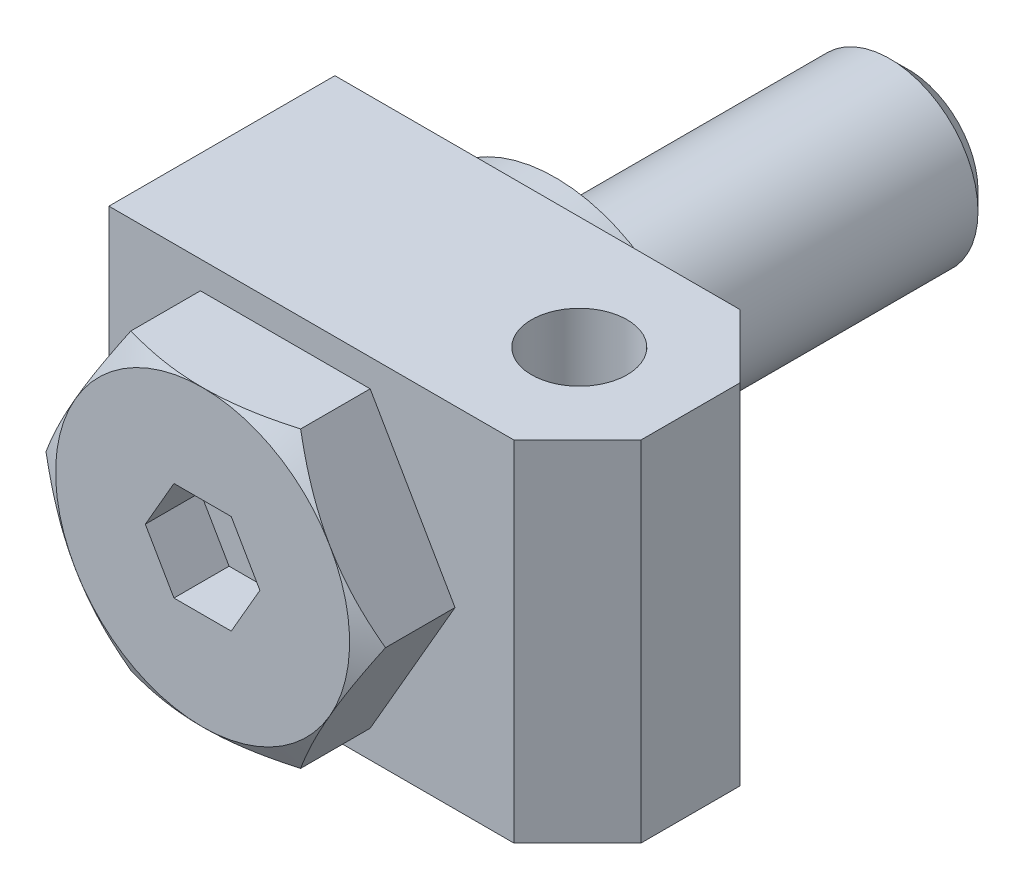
ISO-10303-21;
HEADER;
FILE_DESCRIPTION(('STEP AP214'),'2;1');
FILE_NAME('part.step','',(''),(''),'','','');
FILE_SCHEMA(('AUTOMOTIVE_DESIGN { 1 0 10303 214 1 1 1 1 }'));
ENDSEC;
DATA;
#1=APPLICATION_CONTEXT('core data for automotive mechanical design processes');
#2=APPLICATION_PROTOCOL_DEFINITION('international standard','automotive_design',2000,#1);
#3=PRODUCT_CONTEXT('',#1,'mechanical');
#4=PRODUCT('Part','Part','',(#3));
#5=PRODUCT_RELATED_PRODUCT_CATEGORY('part','',(#4));
#6=PRODUCT_DEFINITION_FORMATION('','',#4);
#7=PRODUCT_DEFINITION_CONTEXT('part definition',#1,'design');
#8=PRODUCT_DEFINITION('design','',#6,#7);
#9=PRODUCT_DEFINITION_SHAPE('','',#8);
#10=(LENGTH_UNIT() NAMED_UNIT(*) SI_UNIT(.MILLI.,.METRE.));
#11=(NAMED_UNIT(*) PLANE_ANGLE_UNIT() SI_UNIT($,.RADIAN.));
#12=(NAMED_UNIT(*) SI_UNIT($,.STERADIAN.) SOLID_ANGLE_UNIT());
#13=UNCERTAINTY_MEASURE_WITH_UNIT(LENGTH_MEASURE(1.E-05),#10,'distance_accuracy_value','');
#14=(GEOMETRIC_REPRESENTATION_CONTEXT(3) GLOBAL_UNCERTAINTY_ASSIGNED_CONTEXT((#13)) GLOBAL_UNIT_ASSIGNED_CONTEXT((#10,
#11,#12)) REPRESENTATION_CONTEXT('',''));
#15=CARTESIAN_POINT('',(0.,0.,0.));
#16=DIRECTION('',(0.,0.,1.));
#17=DIRECTION('',(1.,0.,0.));
#18=AXIS2_PLACEMENT_3D('',#15,#16,#17);
#19=CARTESIAN_POINT('',(-23.0940107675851,40.,96.));
#20=DIRECTION('',(0.866025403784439,-0.5,0.));
#21=DIRECTION('',(0.5,0.866025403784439,0.));
#22=AXIS2_PLACEMENT_3D('',#19,#20,#21);
#23=PLANE('',#22);
#24=CARTESIAN_POINT('',(-23.0938952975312,40.0002,92.4272774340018));
#25=CARTESIAN_POINT('',(-23.6014909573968,39.1210185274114,92.7203150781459));
#26=CARTESIAN_POINT('',(-24.1110665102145,38.238407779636,93.0000549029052));
#27=CARTESIAN_POINT('',(-25.1343037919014,36.4661088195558,93.5292426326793));
#28=CARTESIAN_POINT('',(-25.647966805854,35.5764183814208,93.778680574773));
#29=CARTESIAN_POINT('',(-26.6803826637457,33.7882216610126,94.2439164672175));
#30=CARTESIAN_POINT('',(-27.1991446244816,32.889699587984,94.4596340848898));
#31=CARTESIAN_POINT('',(-28.240251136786,31.0864502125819,94.852782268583));
#32=CARTESIAN_POINT('',(-28.7625953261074,30.1817235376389,95.0302166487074));
#33=CARTESIAN_POINT('',(-29.7975148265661,28.3891903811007,95.339266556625));
#34=CARTESIAN_POINT('',(-30.3100133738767,27.5015168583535,95.4719041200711));
#35=CARTESIAN_POINT('',(-31.3373587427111,25.7221024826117,95.6943063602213));
#36=CARTESIAN_POINT('',(-31.8522056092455,24.8303615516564,95.7840702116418));
#37=CARTESIAN_POINT('',(-32.8827641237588,23.0453818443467,95.9184585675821));
#38=CARTESIAN_POINT('',(-33.3984740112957,22.1521461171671,95.9631367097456));
#39=CARTESIAN_POINT('',(-34.4303697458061,20.3648502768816,96.00639275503));
#40=CARTESIAN_POINT('',(-34.9465555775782,19.470790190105,96.0049720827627));
#41=CARTESIAN_POINT('',(-35.9115675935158,17.7993403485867,95.9592512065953));
#42=CARTESIAN_POINT('',(-36.3604625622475,17.0218314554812,95.9205262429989));
#43=CARTESIAN_POINT('',(-37.2571819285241,15.4686679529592,95.8089469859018));
#44=CARTESIAN_POINT('',(-37.7050063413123,14.6930133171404,95.736093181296));
#45=CARTESIAN_POINT('',(-38.599413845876,13.1438540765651,95.5575231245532));
#46=CARTESIAN_POINT('',(-39.0459954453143,12.3703520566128,95.4517771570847));
#47=CARTESIAN_POINT('',(-39.9370359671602,10.8270246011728,95.2092782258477));
#48=CARTESIAN_POINT('',(-40.3814948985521,10.0571991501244,95.0725253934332));
#49=CARTESIAN_POINT('',(-41.2777261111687,8.50488115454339,94.7668358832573));
#50=CARTESIAN_POINT('',(-41.7294432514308,7.72248411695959,94.5972553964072));
#51=CARTESIAN_POINT('',(-42.6301128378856,6.16247863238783,94.2304349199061));
#52=CARTESIAN_POINT('',(-43.079064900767,5.3848708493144,94.0331911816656));
#53=CARTESIAN_POINT('',(-43.9731516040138,3.83626725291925,93.6140290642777));
#54=CARTESIAN_POINT('',(-44.4182919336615,3.06526158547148,93.3921589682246));
#55=CARTESIAN_POINT('',(-45.3054937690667,1.52858292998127,92.9259575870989));
#56=CARTESIAN_POINT('',(-45.7475561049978,0.762908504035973,92.6816326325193));
#57=CARTESIAN_POINT('',(-46.1881370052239,-0.000200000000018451,92.4272774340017));
#58=B_SPLINE_CURVE_WITH_KNOTS('',3,(#24,#25,#26,#27,#28,#29,#30,#31,#32,#33,#34,#35,#36,#37,#38,
#39,#40,#41,#42,#43,#44,#45,#46,#47,#48,#49,#50,#51,#52,#53,#54,#55,#56,#57),.UNSPECIFIED.,.F.,
.F.,(4,2,2,2,2,2,2,2,2,2,2,2,2,2,2,2,4),(0.,3.16999780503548,6.34103506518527,9.51951526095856,
12.6976786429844,15.7974647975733,18.897310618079,21.99346424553,25.089522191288,
27.7847468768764,30.4799329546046,33.177561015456,35.8751776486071,38.6323432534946,
41.389882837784,44.1421083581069,46.8935603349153),.UNSPECIFIED.);
#59=CARTESIAN_POINT('',(-23.0940107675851,40.,92.4273441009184));
#60=VERTEX_POINT('',#59);
#61=CARTESIAN_POINT('',(-34.6410161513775,20.,96.));
#62=VERTEX_POINT('',#61);
#63=EDGE_CURVE('E331',#60,#62,#58,.T.);
#64=ORIENTED_EDGE('',*,*,#63,.F.);
#65=DIRECTION('',(0.,0.,-1.));
#66=VECTOR('',#65,1.);
#67=CARTESIAN_POINT('',(-23.0940107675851,40.,96.));
#68=LINE('',#67,#66);
#69=CARTESIAN_POINT('',(-23.0940107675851,40.,73.5));
#70=VERTEX_POINT('',#69);
#71=EDGE_CURVE('E436',#60,#70,#68,.T.);
#72=ORIENTED_EDGE('',*,*,#71,.T.);
#73=DIRECTION('',(-0.5,-0.866025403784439,0.));
#74=VECTOR('',#73,1.);
#75=CARTESIAN_POINT('',(-23.0940107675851,40.,73.5));
#76=LINE('',#75,#74);
#77=CARTESIAN_POINT('',(-46.1880215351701,0.,73.5));
#78=VERTEX_POINT('',#77);
#79=EDGE_CURVE('E423',#70,#78,#76,.T.);
#80=ORIENTED_EDGE('',*,*,#79,.T.);
#81=DIRECTION('',(0.,0.,-1.));
#82=VECTOR('',#81,1.);
#83=CARTESIAN_POINT('',(-46.1880215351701,0.,96.));
#84=LINE('',#83,#82);
#85=CARTESIAN_POINT('',(-46.1880215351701,0.,92.4273441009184));
#86=VERTEX_POINT('',#85);
#87=EDGE_CURVE('E334',#86,#78,#84,.T.);
#88=ORIENTED_EDGE('',*,*,#87,.F.);
#89=EDGE_CURVE('E234',#62,#86,#58,.T.);
#90=ORIENTED_EDGE('',*,*,#89,.F.);
#91=EDGE_LOOP('',(#64,#72,#80,#88,#90));
#92=FACE_BOUND('',#91,.T.);
#93=ADVANCED_FACE('F14',(#92),#23,.F.);
#94=CARTESIAN_POINT('',(-46.1880215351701,0.,96.));
#95=DIRECTION('',(0.866025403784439,0.5,0.));
#96=DIRECTION('',(-0.5,0.866025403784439,0.));
#97=AXIS2_PLACEMENT_3D('',#94,#95,#96);
#98=PLANE('',#97);
#99=CARTESIAN_POINT('',(-46.1881370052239,0.000199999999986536,92.4272774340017));
#100=CARTESIAN_POINT('',(-45.6805413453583,-0.878981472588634,92.7203150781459));
#101=CARTESIAN_POINT('',(-45.1709657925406,-1.76159222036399,93.0000549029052));
#102=CARTESIAN_POINT('',(-44.1477285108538,-3.53389118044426,93.5292426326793));
#103=CARTESIAN_POINT('',(-43.6340654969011,-4.4235816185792,93.778680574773));
#104=CARTESIAN_POINT('',(-42.6016496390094,-6.21177833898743,94.2439164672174));
#105=CARTESIAN_POINT('',(-42.0828876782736,-7.110300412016,94.4596340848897));
#106=CARTESIAN_POINT('',(-41.0417811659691,-8.91354978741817,94.852782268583));
#107=CARTESIAN_POINT('',(-40.5194369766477,-9.81827646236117,95.0302166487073));
#108=CARTESIAN_POINT('',(-39.4845174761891,-11.6108096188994,95.339266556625));
#109=CARTESIAN_POINT('',(-38.9720189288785,-12.4984831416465,95.4719041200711));
#110=CARTESIAN_POINT('',(-37.9446735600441,-14.2778975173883,95.6943063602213));
#111=CARTESIAN_POINT('',(-37.4298266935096,-15.1696384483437,95.7840702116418));
#112=CARTESIAN_POINT('',(-36.3992681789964,-16.9546181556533,95.9184585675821));
#113=CARTESIAN_POINT('',(-35.8835582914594,-17.8478538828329,95.9631367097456));
#114=CARTESIAN_POINT('',(-34.8516625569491,-19.6351497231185,96.00639275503));
#115=CARTESIAN_POINT('',(-34.3354767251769,-20.529209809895,96.0049720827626));
#116=CARTESIAN_POINT('',(-33.3704647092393,-22.2006596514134,95.9592512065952));
#117=CARTESIAN_POINT('',(-32.9215697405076,-22.9781685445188,95.9205262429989));
#118=CARTESIAN_POINT('',(-32.024850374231,-24.5313320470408,95.8089469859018));
#119=CARTESIAN_POINT('',(-31.5770259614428,-25.3069866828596,95.7360931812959));
#120=CARTESIAN_POINT('',(-30.6826184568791,-26.8561459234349,95.5575231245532));
#121=CARTESIAN_POINT('',(-30.2360368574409,-27.6296479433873,95.4517771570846));
#122=CARTESIAN_POINT('',(-29.3449963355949,-29.1729753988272,95.2092782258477));
#123=CARTESIAN_POINT('',(-28.9005374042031,-29.9428008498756,95.0725253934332));
#124=CARTESIAN_POINT('',(-28.0043061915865,-31.4951188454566,94.7668358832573));
#125=CARTESIAN_POINT('',(-27.5525890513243,-32.2775158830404,94.5972553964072));
#126=CARTESIAN_POINT('',(-26.6519194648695,-33.8375213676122,94.2304349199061));
#127=CARTESIAN_POINT('',(-26.2029674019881,-34.6151291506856,94.0331911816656));
#128=CARTESIAN_POINT('',(-25.3088806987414,-36.1637327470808,93.6140290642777));
#129=CARTESIAN_POINT('',(-24.8637403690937,-36.9347384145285,93.3921589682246));
#130=CARTESIAN_POINT('',(-23.9765385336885,-38.4714170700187,92.9259575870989));
#131=CARTESIAN_POINT('',(-23.5344761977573,-39.237091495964,92.6816326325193));
#132=CARTESIAN_POINT('',(-23.0938952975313,-40.0002,92.4272774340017));
#133=B_SPLINE_CURVE_WITH_KNOTS('',3,(#99,#100,#101,#102,#103,#104,#105,#106,#107,#108,#109,#110,
#111,#112,#113,#114,#115,#116,#117,#118,#119,#120,#121,#122,#123,#124,#125,#126,#127,#128,#129,
#130,#131,#132),.UNSPECIFIED.,.F.,.F.,(4,2,2,2,2,2,2,2,2,2,2,2,2,2,2,2,4),(0.,3.16999780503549,
6.34103506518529,9.51951526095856,12.6976786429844,15.7974647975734,18.897310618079,
21.9934642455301,25.089522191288,27.7847468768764,30.4799329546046,33.177561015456,
35.8751776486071,38.6323432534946,41.3898828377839,44.1421083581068,46.8935603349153),.UNSPECIFIED.);
#134=CARTESIAN_POINT('',(-34.6410161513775,-20.,96.));
#135=VERTEX_POINT('',#134);
#136=EDGE_CURVE('E232',#86,#135,#133,.T.);
#137=ORIENTED_EDGE('',*,*,#136,.F.);
#138=ORIENTED_EDGE('',*,*,#87,.T.);
#139=DIRECTION('',(0.5,-0.866025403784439,0.));
#140=VECTOR('',#139,1.);
#141=CARTESIAN_POINT('',(-46.1880215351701,0.,73.5));
#142=LINE('',#141,#140);
#143=CARTESIAN_POINT('',(-23.0940107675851,-40.,73.5));
#144=VERTEX_POINT('',#143);
#145=EDGE_CURVE('E347',#78,#144,#142,.T.);
#146=ORIENTED_EDGE('',*,*,#145,.T.);
#147=DIRECTION('',(0.,0.,-1.));
#148=VECTOR('',#147,1.);
#149=CARTESIAN_POINT('',(-23.0940107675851,-40.,96.));
#150=LINE('',#149,#148);
#151=CARTESIAN_POINT('',(-23.0940107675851,-40.,92.4273441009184));
#152=VERTEX_POINT('',#151);
#153=EDGE_CURVE('E344',#152,#144,#150,.T.);
#154=ORIENTED_EDGE('',*,*,#153,.F.);
#155=EDGE_CURVE('E226',#135,#152,#133,.T.);
#156=ORIENTED_EDGE('',*,*,#155,.F.);
#157=EDGE_LOOP('',(#137,#138,#146,#154,#156));
#158=FACE_BOUND('',#157,.T.);
#159=ADVANCED_FACE('F241',(#158),#98,.F.);
#160=CARTESIAN_POINT('',(-23.0940107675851,-40.,96.));
#161=DIRECTION('',(0.,1.,0.));
#162=DIRECTION('',(-1.,0.,0.));
#163=AXIS2_PLACEMENT_3D('',#160,#161,#162);
#164=PLANE('',#163);
#165=CARTESIAN_POINT('',(-61.9153635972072,-40.,76.5361589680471));
#166=CARTESIAN_POINT('',(-61.0423729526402,-40.,76.959503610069));
#167=CARTESIAN_POINT('',(-60.1683540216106,-40.,77.3807349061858));
#168=CARTESIAN_POINT('',(-58.4180464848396,-40.,78.2184770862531));
#169=CARTESIAN_POINT('',(-57.5417578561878,-40.,78.6349879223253));
#170=CARTESIAN_POINT('',(-55.7865789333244,-40.,79.4628512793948));
#171=CARTESIAN_POINT('',(-54.9076882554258,-40.,79.8742029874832));
#172=CARTESIAN_POINT('',(-53.1472115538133,-40.,80.6910955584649));
#173=CARTESIAN_POINT('',(-52.2656255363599,-40.,81.0966364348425));
#174=CARTESIAN_POINT('',(-50.4946593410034,-40.,81.9034513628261));
#175=CARTESIAN_POINT('',(-49.6052629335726,-40.,82.3046898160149));
#176=CARTESIAN_POINT('',(-47.8232052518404,-40.,83.0998482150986));
#177=CARTESIAN_POINT('',(-46.9305439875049,-40.,83.4937681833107));
#178=CARTESIAN_POINT('',(-45.1416757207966,-40.,84.2733908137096));
#179=CARTESIAN_POINT('',(-44.2454688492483,-40.,84.6590937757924));
#180=CARTESIAN_POINT('',(-42.4491475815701,-40.,85.4212764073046));
#181=CARTESIAN_POINT('',(-41.5490332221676,-40.,85.7977561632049));
#182=CARTESIAN_POINT('',(-39.7157432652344,-40.,86.5521723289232));
#183=CARTESIAN_POINT('',(-38.7824289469,-40.,86.9297721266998));
#184=CARTESIAN_POINT('',(-36.9108159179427,-40.,87.6724351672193));
#185=CARTESIAN_POINT('',(-35.9725171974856,-40.,88.0374983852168));
#186=CARTESIAN_POINT('',(-34.0903732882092,-40.,88.7534314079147));
#187=CARTESIAN_POINT('',(-33.1465274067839,-40.,89.1042993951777));
#188=CARTESIAN_POINT('',(-31.2529628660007,-40.,89.7898372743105));
#189=CARTESIAN_POINT('',(-30.30324423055,-40.,90.1245072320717));
#190=CARTESIAN_POINT('',(-28.3994618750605,-40.,90.7747495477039));
#191=CARTESIAN_POINT('',(-27.4454111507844,-40.,91.0903598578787));
#192=CARTESIAN_POINT('',(-25.5306247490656,-40.,91.7007292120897));
#193=CARTESIAN_POINT('',(-24.5698889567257,-40.,91.9954878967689));
#194=CARTESIAN_POINT('',(-22.6417154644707,-40.,92.5612753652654));
#195=CARTESIAN_POINT('',(-21.6742796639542,-40.,92.8323105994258));
#196=CARTESIAN_POINT('',(-19.7323282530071,-40.,93.3476757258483));
#197=CARTESIAN_POINT('',(-18.7578128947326,-40.,93.5920065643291));
#198=CARTESIAN_POINT('',(-16.8070668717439,-40.,94.0494666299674));
#199=CARTESIAN_POINT('',(-15.830874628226,-40.,94.2627589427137));
#200=CARTESIAN_POINT('',(-13.8718621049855,-40.,94.6564334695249));
#201=CARTESIAN_POINT('',(-12.8890419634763,-40.,94.8368163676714));
#202=CARTESIAN_POINT('',(-10.9174521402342,-40.,95.1614788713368));
#203=CARTESIAN_POINT('',(-9.92868264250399,-40.,95.3057595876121));
#204=CARTESIAN_POINT('',(-7.94620353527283,-40.,95.5553437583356));
#205=CARTESIAN_POINT('',(-6.95249392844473,-40.,95.6606472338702));
#206=CARTESIAN_POINT('',(-4.97449889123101,-40.,95.8288625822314));
#207=CARTESIAN_POINT('',(-3.99025914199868,-40.,95.892308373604));
#208=CARTESIAN_POINT('',(-2.01997858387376,-40.,95.977527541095));
#209=CARTESIAN_POINT('',(-1.03393780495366,-40.,95.9993016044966));
#210=CARTESIAN_POINT('',(0.938174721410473,-40.,96.0006653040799));
#211=CARTESIAN_POINT('',(1.92424646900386,-40.,95.98025468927));
#212=CARTESIAN_POINT('',(3.89469020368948,-40.,95.8977246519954));
#213=CARTESIAN_POINT('',(4.87906211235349,-40.,95.8356033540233));
#214=CARTESIAN_POINT('',(6.55505255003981,-40.,95.6953094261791));
#215=CARTESIAN_POINT('',(7.24753790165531,-40.,95.627246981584));
#216=CARTESIAN_POINT('',(8.63034783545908,-40.,95.4718259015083));
#217=CARTESIAN_POINT('',(9.32067235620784,-40.,95.384466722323));
#218=CARTESIAN_POINT('',(11.3878729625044,-40.,95.0947214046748));
#219=CARTESIAN_POINT('',(12.7609398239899,-40.,94.8646706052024));
#220=CARTESIAN_POINT('',(15.4953542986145,-40.,94.3389379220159));
#221=CARTESIAN_POINT('',(16.8566918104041,-40.,94.0432043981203));
#222=CARTESIAN_POINT('',(19.5657024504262,-40.,93.3951346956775));
#223=CARTESIAN_POINT('',(20.913375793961,-40.,93.0427994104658));
#224=CARTESIAN_POINT('',(23.6244955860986,-40.,92.2818091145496));
#225=CARTESIAN_POINT('',(24.9876410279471,-40.,91.8720896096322));
#226=CARTESIAN_POINT('',(27.7005016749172,-40.,91.010596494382));
#227=CARTESIAN_POINT('',(29.0502167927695,-40.,90.55882261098));
#228=CARTESIAN_POINT('',(31.7368983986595,-40.,89.620368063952));
#229=CARTESIAN_POINT('',(33.0738690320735,-40.,89.1336992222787));
#230=CARTESIAN_POINT('',(35.0710130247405,-40.,88.3817884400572));
#231=CARTESIAN_POINT('',(35.7353425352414,-40.,88.1275001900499));
#232=CARTESIAN_POINT('',(37.0614058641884,-40.,87.6122318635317));
#233=CARTESIAN_POINT('',(37.7231396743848,-40.,87.3512517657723));
#234=CARTESIAN_POINT('',(39.2625096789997,-40.,86.7358979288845));
#235=CARTESIAN_POINT('',(40.1392047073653,-40.,86.3791700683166));
#236=CARTESIAN_POINT('',(41.8886202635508,-40.,85.6560886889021));
#237=CARTESIAN_POINT('',(42.7613407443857,-40.,85.2897350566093));
#238=CARTESIAN_POINT('',(45.3741113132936,-40.,84.1778166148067));
#239=CARTESIAN_POINT('',(47.1087071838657,-40.,83.4194197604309));
#240=CARTESIAN_POINT('',(50.5660162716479,-40.,81.8751827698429));
#241=CARTESIAN_POINT('',(52.2887269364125,-40.,81.0893369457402));
#242=CARTESIAN_POINT('',(55.7238591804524,-40.,79.4955945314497));
#243=CARTESIAN_POINT('',(57.4362809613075,-40.,78.6876983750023));
#244=CARTESIAN_POINT('',(60.8542773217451,-40.,77.0530548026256));
#245=CARTESIAN_POINT('',(62.5598429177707,-40.,76.2262886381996));
#246=CARTESIAN_POINT('',(65.963684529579,-40.,74.557886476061));
#247=CARTESIAN_POINT('',(67.6619605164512,-40.,73.7162504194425));
#248=CARTESIAN_POINT('',(71.0521204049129,-40.,72.0207097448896));
#249=CARTESIAN_POINT('',(72.7440050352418,-40.,71.166806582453));
#250=CARTESIAN_POINT('',(76.1224881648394,-40.,69.448621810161));
#251=CARTESIAN_POINT('',(77.8090866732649,-40.,68.5843402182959));
#252=CARTESIAN_POINT('',(81.0405076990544,-40.,66.9177689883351));
#253=CARTESIAN_POINT('',(82.5856847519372,-40.,66.1161662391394));
#254=CARTESIAN_POINT('',(85.6726988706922,-40.,64.5065516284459));
#255=CARTESIAN_POINT('',(87.2145359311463,-40.,63.6985397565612));
#256=CARTESIAN_POINT('',(90.2953253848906,-40.,62.0769218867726));
#257=CARTESIAN_POINT('',(91.8342776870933,-40.,61.2633157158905));
#258=CARTESIAN_POINT('',(94.9095985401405,-40.,59.63123440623));
#259=CARTESIAN_POINT('',(96.4459670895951,-40.,58.8127592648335));
#260=CARTESIAN_POINT('',(99.5127482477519,-40.,57.1734918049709));
#261=CARTESIAN_POINT('',(101.043166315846,-40.,56.3527096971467));
#262=CARTESIAN_POINT('',(104.101979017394,-40.,54.7073832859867));
#263=CARTESIAN_POINT('',(105.630373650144,-40.,53.8828389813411));
#264=CARTESIAN_POINT('',(108.685277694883,-40.,52.2304582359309));
#265=CARTESIAN_POINT('',(110.211787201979,-40.,51.4026219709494));
#266=CARTESIAN_POINT('',(113.263182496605,-40.,49.7439677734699));
#267=CARTESIAN_POINT('',(114.788068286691,-40.,48.9131498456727));
#268=CARTESIAN_POINT('',(116.312235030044,-40.,48.0810166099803));
#269=B_SPLINE_CURVE_WITH_KNOTS('',3,(#165,#166,#167,#168,#169,#170,#171,#172,#173,#174,#175,
#176,#177,#178,#179,#180,#181,#182,#183,#184,#185,#186,#187,#188,#189,#190,#191,#192,#193,#194,
#195,#196,#197,#198,#199,#200,#201,#202,#203,#204,#205,#206,#207,#208,#209,#210,#211,#212,#213,
#214,#215,#216,#217,#218,#219,#220,#221,#222,#223,#224,#225,#226,#227,#228,#229,#230,#231,#232,
#233,#234,#235,#236,#237,#238,#239,#240,#241,#242,#243,#244,#245,#246,#247,#248,#249,#250,#251,
#252,#253,#254,#255,#256,#257,#258,#259,#260,#261,#262,#263,#264,#265,#266,#267,#268),
.UNSPECIFIED.,.F.,.F.,(4,2,2,2,2,2,2,2,2,2,2,2,2,2,2,2,2,2,2,2,2,2,2,2,2,2,2,2,2,2,2,2,2,2,2,2,
2,2,2,2,2,2,2,2,2,2,2,2,2,2,2,4),(0.,2.91067180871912,5.82137311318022,8.7325274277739,
11.6436749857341,14.5707882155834,17.4978925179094,20.4248898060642,23.3518596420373,
26.3721958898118,29.3925380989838,32.4132657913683,35.4339811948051,38.4484685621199,
41.4630078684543,44.4767249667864,47.490335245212,50.4874902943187,53.4845830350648,
56.4815835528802,59.4785824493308,62.43657319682,65.3945151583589,68.3524747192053,
71.3105672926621,73.3977672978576,75.4850261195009,79.6596528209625,83.8375733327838,
88.0154279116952,92.2847852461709,96.5541703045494,100.822115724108,102.956089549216,
105.090070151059,107.92948116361,110.768925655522,116.448019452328,122.128297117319,
127.80846312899,133.494542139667,139.180643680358,144.866076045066,150.551498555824,
155.773670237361,160.995850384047,166.218192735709,171.440537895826,176.650403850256,
181.860271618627,187.069864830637,192.279449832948),.UNSPECIFIED.);
#270=CARTESIAN_POINT('',(0.,-40.,96.));
#271=VERTEX_POINT('',#270);
#272=EDGE_CURVE('E233',#152,#271,#269,.T.);
#273=ORIENTED_EDGE('',*,*,#272,.F.);
#274=ORIENTED_EDGE('',*,*,#153,.T.);
#275=DIRECTION('',(1.,0.,0.));
#276=VECTOR('',#275,1.);
#277=CARTESIAN_POINT('',(-23.0940107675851,-40.,73.5));
#278=LINE('',#277,#276);
#279=CARTESIAN_POINT('',(23.094010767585,-40.,73.5));
#280=VERTEX_POINT('',#279);
#281=EDGE_CURVE('E426',#144,#280,#278,.T.);
#282=ORIENTED_EDGE('',*,*,#281,.T.);
#283=DIRECTION('',(0.,0.,-1.));
#284=VECTOR('',#283,1.);
#285=CARTESIAN_POINT('',(23.094010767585,-40.,96.));
#286=LINE('',#285,#284);
#287=CARTESIAN_POINT('',(23.094010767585,-40.,92.4273441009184));
#288=VERTEX_POINT('',#287);
#289=EDGE_CURVE('E349',#288,#280,#286,.T.);
#290=ORIENTED_EDGE('',*,*,#289,.F.);
#291=EDGE_CURVE('E160',#271,#288,#269,.T.);
#292=ORIENTED_EDGE('',*,*,#291,.F.);
#293=EDGE_LOOP('',(#273,#274,#282,#290,#292));
#294=FACE_BOUND('',#293,.T.);
#295=ADVANCED_FACE('F244',(#294),#164,.F.);
#296=CARTESIAN_POINT('',(23.094010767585,-40.,96.));
#297=DIRECTION('',(-0.866025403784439,0.5,0.));
#298=DIRECTION('',(-0.5,-0.866025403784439,0.));
#299=AXIS2_PLACEMENT_3D('',#296,#297,#298);
#300=PLANE('',#299);
#301=CARTESIAN_POINT('',(23.0938952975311,-40.0002,92.4272774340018));
#302=CARTESIAN_POINT('',(23.6014909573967,-39.1210185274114,92.7203150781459));
#303=CARTESIAN_POINT('',(24.1110665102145,-38.238407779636,93.0000549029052));
#304=CARTESIAN_POINT('',(25.1343037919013,-36.4661088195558,93.5292426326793));
#305=CARTESIAN_POINT('',(25.647966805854,-35.5764183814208,93.778680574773));
#306=CARTESIAN_POINT('',(26.6803826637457,-33.7882216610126,94.2439164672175));
#307=CARTESIAN_POINT('',(27.1991446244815,-32.889699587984,94.4596340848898));
#308=CARTESIAN_POINT('',(28.240251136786,-31.0864502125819,94.852782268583));
#309=CARTESIAN_POINT('',(28.7625953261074,-30.1817235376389,95.0302166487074));
#310=CARTESIAN_POINT('',(29.797514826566,-28.3891903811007,95.339266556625));
#311=CARTESIAN_POINT('',(30.3100133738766,-27.5015168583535,95.4719041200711));
#312=CARTESIAN_POINT('',(31.337358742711,-25.7221024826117,95.6943063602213));
#313=CARTESIAN_POINT('',(31.8522056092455,-24.8303615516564,95.7840702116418));
#314=CARTESIAN_POINT('',(32.8827641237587,-23.0453818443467,95.9184585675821));
#315=CARTESIAN_POINT('',(33.3984740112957,-22.1521461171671,95.9631367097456));
#316=CARTESIAN_POINT('',(34.430369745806,-20.3648502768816,96.00639275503));
#317=CARTESIAN_POINT('',(34.9465555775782,-19.470790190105,96.0049720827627));
#318=CARTESIAN_POINT('',(35.9115675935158,-17.7993403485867,95.9592512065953));
#319=CARTESIAN_POINT('',(36.3604625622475,-17.0218314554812,95.9205262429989));
#320=CARTESIAN_POINT('',(37.2571819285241,-15.4686679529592,95.8089469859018));
#321=CARTESIAN_POINT('',(37.7050063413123,-14.6930133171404,95.736093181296));
#322=CARTESIAN_POINT('',(38.599413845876,-13.1438540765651,95.5575231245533));
#323=CARTESIAN_POINT('',(39.0459954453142,-12.3703520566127,95.4517771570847));
#324=CARTESIAN_POINT('',(39.9370359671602,-10.8270246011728,95.2092782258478));
#325=CARTESIAN_POINT('',(40.381494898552,-10.0571991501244,95.0725253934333));
#326=CARTESIAN_POINT('',(41.2777261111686,-8.50488115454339,94.7668358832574));
#327=CARTESIAN_POINT('',(41.7294432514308,-7.72248411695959,94.5972553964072));
#328=CARTESIAN_POINT('',(42.6301128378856,-6.16247863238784,94.2304349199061));
#329=CARTESIAN_POINT('',(43.079064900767,-5.38487084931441,94.0331911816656));
#330=CARTESIAN_POINT('',(43.9731516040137,-3.83626725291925,93.6140290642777));
#331=CARTESIAN_POINT('',(44.4182919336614,-3.06526158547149,93.3921589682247));
#332=CARTESIAN_POINT('',(45.3054937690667,-1.52858292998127,92.925957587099));
#333=CARTESIAN_POINT('',(45.7475561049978,-0.762908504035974,92.6816326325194));
#334=CARTESIAN_POINT('',(46.1881370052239,0.000200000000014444,92.4272774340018));
#335=B_SPLINE_CURVE_WITH_KNOTS('',3,(#301,#302,#303,#304,#305,#306,#307,#308,#309,#310,#311,
#312,#313,#314,#315,#316,#317,#318,#319,#320,#321,#322,#323,#324,#325,#326,#327,#328,#329,#330,
#331,#332,#333,#334),.UNSPECIFIED.,.F.,.F.,(4,2,2,2,2,2,2,2,2,2,2,2,2,2,2,2,4),(0.,
3.16999780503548,6.34103506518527,9.51951526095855,12.6976786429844,15.7974647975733,
18.897310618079,21.99346424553,25.089522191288,27.7847468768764,30.4799329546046,
33.177561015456,35.8751776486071,38.6323432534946,41.389882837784,44.1421083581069,
46.8935603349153),.UNSPECIFIED.);
#336=CARTESIAN_POINT('',(34.6410161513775,-20.,96.));
#337=VERTEX_POINT('',#336);
#338=EDGE_CURVE('E156',#288,#337,#335,.T.);
#339=ORIENTED_EDGE('',*,*,#338,.F.);
#340=ORIENTED_EDGE('',*,*,#289,.T.);
#341=DIRECTION('',(0.5,0.866025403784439,0.));
#342=VECTOR('',#341,1.);
#343=CARTESIAN_POINT('',(23.094010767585,-40.,73.5));
#344=LINE('',#343,#342);
#345=CARTESIAN_POINT('',(46.18802153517,0.,73.5));
#346=VERTEX_POINT('',#345);
#347=EDGE_CURVE('E428',#280,#346,#344,.T.);
#348=ORIENTED_EDGE('',*,*,#347,.T.);
#349=DIRECTION('',(0.,0.,-1.));
#350=VECTOR('',#349,1.);
#351=CARTESIAN_POINT('',(46.18802153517,0.,96.));
#352=LINE('',#351,#350);
#353=CARTESIAN_POINT('',(46.18802153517,0.,92.4273441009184));
#354=VERTEX_POINT('',#353);
#355=EDGE_CURVE('E181',#354,#346,#352,.T.);
#356=ORIENTED_EDGE('',*,*,#355,.F.);
#357=EDGE_CURVE('E164',#337,#354,#335,.T.);
#358=ORIENTED_EDGE('',*,*,#357,.F.);
#359=EDGE_LOOP('',(#339,#340,#348,#356,#358));
#360=FACE_BOUND('',#359,.T.);
#361=ADVANCED_FACE('F179',(#360),#300,.F.);
#362=CARTESIAN_POINT('',(46.18802153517,0.,96.));
#363=DIRECTION('',(-0.866025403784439,-0.5,0.));
#364=DIRECTION('',(0.5,-0.866025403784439,0.));
#365=AXIS2_PLACEMENT_3D('',#362,#363,#364);
#366=PLANE('',#365);
#367=CARTESIAN_POINT('',(46.1881370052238,-0.000199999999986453,92.4272774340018));
#368=CARTESIAN_POINT('',(45.6805413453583,0.878981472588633,92.720315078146));
#369=CARTESIAN_POINT('',(45.1709657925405,1.76159222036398,93.0000549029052));
#370=CARTESIAN_POINT('',(44.1477285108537,3.53389118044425,93.5292426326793));
#371=CARTESIAN_POINT('',(43.634065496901,4.42358161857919,93.7786805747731));
#372=CARTESIAN_POINT('',(42.6016496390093,6.21177833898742,94.2439164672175));
#373=CARTESIAN_POINT('',(42.0828876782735,7.11030041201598,94.4596340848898));
#374=CARTESIAN_POINT('',(41.041781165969,8.91354978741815,94.852782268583));
#375=CARTESIAN_POINT('',(40.5194369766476,9.81827646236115,95.0302166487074));
#376=CARTESIAN_POINT('',(39.484517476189,11.6108096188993,95.339266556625));
#377=CARTESIAN_POINT('',(38.9720189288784,12.4984831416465,95.4719041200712));
#378=CARTESIAN_POINT('',(37.944673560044,14.2778975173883,95.6943063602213));
#379=CARTESIAN_POINT('',(37.4298266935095,15.1696384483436,95.7840702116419));
#380=CARTESIAN_POINT('',(36.3992681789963,16.9546181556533,95.9184585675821));
#381=CARTESIAN_POINT('',(35.8835582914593,17.8478538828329,95.9631367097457));
#382=CARTESIAN_POINT('',(34.851662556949,19.6351497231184,96.00639275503));
#383=CARTESIAN_POINT('',(34.3354767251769,20.529209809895,96.0049720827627));
#384=CARTESIAN_POINT('',(33.3704647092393,22.2006596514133,95.9592512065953));
#385=CARTESIAN_POINT('',(32.9215697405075,22.9781685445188,95.9205262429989));
#386=CARTESIAN_POINT('',(32.0248503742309,24.5313320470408,95.8089469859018));
#387=CARTESIAN_POINT('',(31.5770259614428,25.3069866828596,95.736093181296));
#388=CARTESIAN_POINT('',(30.682618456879,26.8561459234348,95.5575231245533));
#389=CARTESIAN_POINT('',(30.2360368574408,27.6296479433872,95.4517771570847));
#390=CARTESIAN_POINT('',(29.3449963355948,29.1729753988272,95.2092782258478));
#391=CARTESIAN_POINT('',(28.900537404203,29.9428008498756,95.0725253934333));
#392=CARTESIAN_POINT('',(28.0043061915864,31.4951188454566,94.7668358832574));
#393=CARTESIAN_POINT('',(27.5525890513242,32.2775158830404,94.5972553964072));
#394=CARTESIAN_POINT('',(26.6519194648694,33.8375213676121,94.2304349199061));
#395=CARTESIAN_POINT('',(26.202967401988,34.6151291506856,94.0331911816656));
#396=CARTESIAN_POINT('',(25.3088806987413,36.1637327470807,93.6140290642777));
#397=CARTESIAN_POINT('',(24.8637403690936,36.9347384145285,93.3921589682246));
#398=CARTESIAN_POINT('',(23.9765385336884,38.4714170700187,92.925957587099));
#399=CARTESIAN_POINT('',(23.5344761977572,39.237091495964,92.6816326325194));
#400=CARTESIAN_POINT('',(23.0938952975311,40.0002,92.4272774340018));
#401=B_SPLINE_CURVE_WITH_KNOTS('',3,(#367,#368,#369,#370,#371,#372,#373,#374,#375,#376,#377,
#378,#379,#380,#381,#382,#383,#384,#385,#386,#387,#388,#389,#390,#391,#392,#393,#394,#395,#396,
#397,#398,#399,#400),.UNSPECIFIED.,.F.,.F.,(4,2,2,2,2,2,2,2,2,2,2,2,2,2,2,2,4),(0.,
3.16999780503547,6.34103506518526,9.51951526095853,12.6976786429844,15.7974647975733,
18.8973106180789,21.99346424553,25.0895221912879,27.7847468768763,30.4799329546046,
33.1775610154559,35.8751776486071,38.6323432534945,41.3898828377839,44.1421083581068,
46.8935603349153),.UNSPECIFIED.);
#402=CARTESIAN_POINT('',(34.6410161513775,20.,96.));
#403=VERTEX_POINT('',#402);
#404=EDGE_CURVE('E169',#354,#403,#401,.T.);
#405=ORIENTED_EDGE('',*,*,#404,.F.);
#406=ORIENTED_EDGE('',*,*,#355,.T.);
#407=DIRECTION('',(-0.5,0.866025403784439,0.));
#408=VECTOR('',#407,1.);
#409=CARTESIAN_POINT('',(46.18802153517,0.,73.5));
#410=LINE('',#409,#408);
#411=CARTESIAN_POINT('',(23.094010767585,40.,73.5));
#412=VERTEX_POINT('',#411);
#413=EDGE_CURVE('E430',#346,#412,#410,.T.);
#414=ORIENTED_EDGE('',*,*,#413,.T.);
#415=DIRECTION('',(0.,0.,-1.));
#416=VECTOR('',#415,1.);
#417=CARTESIAN_POINT('',(23.094010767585,40.,96.));
#418=LINE('',#417,#416);
#419=CARTESIAN_POINT('',(23.094010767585,40.,92.4273441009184));
#420=VERTEX_POINT('',#419);
#421=EDGE_CURVE('E438',#420,#412,#418,.T.);
#422=ORIENTED_EDGE('',*,*,#421,.F.);
#423=EDGE_CURVE('E182',#403,#420,#401,.T.);
#424=ORIENTED_EDGE('',*,*,#423,.F.);
#425=EDGE_LOOP('',(#405,#406,#414,#422,#424));
#426=FACE_BOUND('',#425,.T.);
#427=ADVANCED_FACE('F440',(#426),#366,.F.);
#428=CARTESIAN_POINT('',(23.094010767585,40.,96.));
#429=DIRECTION('',(0.,-1.,0.));
#430=DIRECTION('',(1.,0.,0.));
#431=AXIS2_PLACEMENT_3D('',#428,#429,#430);
#432=PLANE('',#431);
#433=CARTESIAN_POINT('',(-61.9153635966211,40.,76.5361589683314));
#434=CARTESIAN_POINT('',(-61.0423729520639,40.,76.9595036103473));
#435=CARTESIAN_POINT('',(-60.1683540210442,40.,77.3807349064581));
#436=CARTESIAN_POINT('',(-58.4180464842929,40.,78.2184770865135));
#437=CARTESIAN_POINT('',(-57.5417578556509,40.,78.6349879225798));
#438=CARTESIAN_POINT('',(-55.7865789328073,40.,79.4628512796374));
#439=CARTESIAN_POINT('',(-54.9076882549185,40.,79.87420298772));
#440=CARTESIAN_POINT('',(-53.1472115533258,40.,80.6910955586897));
#441=CARTESIAN_POINT('',(-52.2656255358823,40.,81.0966364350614));
#442=CARTESIAN_POINT('',(-50.4946593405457,40.,81.9034513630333));
#443=CARTESIAN_POINT('',(-49.6052629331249,40.,82.3046898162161));
#444=CARTESIAN_POINT('',(-47.8232052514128,40.,83.0998482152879));
#445=CARTESIAN_POINT('',(-46.9305439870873,40.,83.4937681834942));
#446=CARTESIAN_POINT('',(-45.1416757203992,40.,84.2733908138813));
#447=CARTESIAN_POINT('',(-44.2454688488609,40.,84.6590937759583));
#448=CARTESIAN_POINT('',(-42.449147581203,40.,85.4212764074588));
#449=CARTESIAN_POINT('',(-41.5490332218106,40.,85.7977561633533));
#450=CARTESIAN_POINT('',(-39.7157432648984,40.,86.5521723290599));
#451=CARTESIAN_POINT('',(-38.7824289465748,40.,86.9297721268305));
#452=CARTESIAN_POINT('',(-36.9108159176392,40.,87.6724351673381));
#453=CARTESIAN_POINT('',(-35.972517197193,40.,88.0374983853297));
#454=CARTESIAN_POINT('',(-34.0903732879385,40.,88.7534314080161));
#455=CARTESIAN_POINT('',(-33.1465274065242,40.,89.1042993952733));
#456=CARTESIAN_POINT('',(-31.252962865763,40.,89.7898372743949));
#457=CARTESIAN_POINT('',(-30.3032442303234,40.,90.1245072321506));
#458=CARTESIAN_POINT('',(-28.3994618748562,40.,90.7747495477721));
#459=CARTESIAN_POINT('',(-27.4454111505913,40.,91.0903598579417));
#460=CARTESIAN_POINT('',(-25.530624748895,40.,91.7007292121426));
#461=CARTESIAN_POINT('',(-24.5698889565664,40.,91.995487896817));
#462=CARTESIAN_POINT('',(-22.6417154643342,40.,92.5612753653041));
#463=CARTESIAN_POINT('',(-21.6742796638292,40.,92.8323105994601));
#464=CARTESIAN_POINT('',(-19.7323282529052,40.,93.3476757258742));
#465=CARTESIAN_POINT('',(-18.7578128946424,40.,93.5920065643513));
#466=CARTESIAN_POINT('',(-16.8070668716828,40.,94.049466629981));
#467=CARTESIAN_POINT('',(-15.8308746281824,40.,94.2627589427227));
#468=CARTESIAN_POINT('',(-13.8718621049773,40.,94.6564334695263));
#469=CARTESIAN_POINT('',(-12.8890419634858,40.,94.8368163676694));
#470=CARTESIAN_POINT('',(-10.9174521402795,40.,95.1614788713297));
#471=CARTESIAN_POINT('',(-9.92868264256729,40.,95.3057595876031));
#472=CARTESIAN_POINT('',(-7.94620353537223,40.,95.5553437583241));
#473=CARTESIAN_POINT('',(-6.95249392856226,40.,95.6606472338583));
#474=CARTESIAN_POINT('',(-4.9744988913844,40.,95.8288625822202));
#475=CARTESIAN_POINT('',(-3.99025914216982,40.,95.8923083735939));
#476=CARTESIAN_POINT('',(-2.01997858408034,40.,95.9775275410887));
#477=CARTESIAN_POINT('',(-1.03393780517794,40.,95.999301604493));
#478=CARTESIAN_POINT('',(0.938174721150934,40.,96.0006653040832));
#479=CARTESIAN_POINT('',(1.92424646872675,40.,95.9802546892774));
#480=CARTESIAN_POINT('',(3.8946902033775,40.,95.8977246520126));
#481=CARTESIAN_POINT('',(4.87906211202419,40.,95.8356033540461));
#482=CARTESIAN_POINT('',(6.55505254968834,40.,95.6953094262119));
#483=CARTESIAN_POINT('',(7.24753790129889,40.,95.6272469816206));
#484=CARTESIAN_POINT('',(8.63034783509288,40.,95.4718259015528));
#485=CARTESIAN_POINT('',(9.32067235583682,40.,95.3844667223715));
#486=CARTESIAN_POINT('',(11.387872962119,40.,95.0947214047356));
#487=CARTESIAN_POINT('',(12.7609398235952,40.,94.8646706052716));
#488=CARTESIAN_POINT('',(15.4953542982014,40.,94.338937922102));
#489=CARTESIAN_POINT('',(16.856691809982,40.,94.0432043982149));
#490=CARTESIAN_POINT('',(19.5657024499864,40.,93.395134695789));
#491=CARTESIAN_POINT('',(20.9133757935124,40.,93.0427994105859));
#492=CARTESIAN_POINT('',(23.6244955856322,40.,92.2818091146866));
#493=CARTESIAN_POINT('',(24.9876410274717,40.,91.8720896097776));
#494=CARTESIAN_POINT('',(27.700501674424,40.,91.0105964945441));
#495=CARTESIAN_POINT('',(29.0502167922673,40.,90.5588226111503));
#496=CARTESIAN_POINT('',(31.7368983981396,40.,89.6203680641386));
#497=CARTESIAN_POINT('',(33.0738690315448,40.,89.1336992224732));
#498=CARTESIAN_POINT('',(35.0710130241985,40.,88.3817884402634));
#499=CARTESIAN_POINT('',(35.735342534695,40.,88.1275001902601));
#500=CARTESIAN_POINT('',(37.0614058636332,40.,87.6122318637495));
#501=CARTESIAN_POINT('',(37.7231396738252,40.,87.351251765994));
#502=CARTESIAN_POINT('',(39.262509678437,40.,86.7358979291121));
#503=CARTESIAN_POINT('',(40.1392047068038,40.,86.3791700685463));
#504=CARTESIAN_POINT('',(41.8886202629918,40.,85.6560886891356));
#505=CARTESIAN_POINT('',(42.7613407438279,40.,85.2897350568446));
#506=CARTESIAN_POINT('',(45.3741113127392,40.,84.1778166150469));
#507=CARTESIAN_POINT('',(47.1087071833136,40.,83.419419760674));
#508=CARTESIAN_POINT('',(50.5660162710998,40.,81.8751827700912));
#509=CARTESIAN_POINT('',(52.2887269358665,40.,81.0893369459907));
#510=CARTESIAN_POINT('',(55.72385917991,40.,79.4955945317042));
#511=CARTESIAN_POINT('',(57.4362809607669,40.,78.6876983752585));
#512=CARTESIAN_POINT('',(60.8542773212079,40.,77.0530548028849));
#513=CARTESIAN_POINT('',(62.5598429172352,40.,76.2262886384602));
#514=CARTESIAN_POINT('',(65.9636845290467,40.,74.5578864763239));
#515=CARTESIAN_POINT('',(67.6619605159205,40.,73.7162504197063));
#516=CARTESIAN_POINT('',(71.0521204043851,40.,72.0207097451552));
#517=CARTESIAN_POINT('',(72.7440050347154,40.,71.1668065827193));
#518=CARTESIAN_POINT('',(76.1224881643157,40.,69.4486218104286));
#519=CARTESIAN_POINT('',(77.8090866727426,40.,68.5843402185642));
#520=CARTESIAN_POINT('',(81.0405076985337,40.,66.9177689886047));
#521=CARTESIAN_POINT('',(82.5856847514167,40.,66.1161662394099));
#522=CARTESIAN_POINT('',(85.6726988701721,40.,64.506551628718));
#523=CARTESIAN_POINT('',(87.2145359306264,40.,63.698539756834));
#524=CARTESIAN_POINT('',(90.2953253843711,40.,62.0769218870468));
#525=CARTESIAN_POINT('',(91.834277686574,40.,61.2633157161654));
#526=CARTESIAN_POINT('',(94.9095985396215,40.,59.6312344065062));
#527=CARTESIAN_POINT('',(96.4459670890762,40.,58.8127592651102));
#528=CARTESIAN_POINT('',(99.512748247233,40.,57.1734918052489));
#529=CARTESIAN_POINT('',(101.043166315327,40.,56.3527096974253));
#530=CARTESIAN_POINT('',(104.101979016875,40.,54.7073832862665));
#531=CARTESIAN_POINT('',(105.630373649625,40.,53.8828389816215));
#532=CARTESIAN_POINT('',(108.685277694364,40.,52.2304582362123));
#533=CARTESIAN_POINT('',(110.211787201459,40.,51.4026219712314));
#534=CARTESIAN_POINT('',(113.263182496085,40.,49.7439677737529));
#535=CARTESIAN_POINT('',(114.788068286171,40.,48.9131498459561));
#536=CARTESIAN_POINT('',(116.312235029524,40.,48.0810166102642));
#537=B_SPLINE_CURVE_WITH_KNOTS('',3,(#433,#434,#435,#436,#437,#438,#439,#440,#441,#442,#443,
#444,#445,#446,#447,#448,#449,#450,#451,#452,#453,#454,#455,#456,#457,#458,#459,#460,#461,#462,
#463,#464,#465,#466,#467,#468,#469,#470,#471,#472,#473,#474,#475,#476,#477,#478,#479,#480,#481,
#482,#483,#484,#485,#486,#487,#488,#489,#490,#491,#492,#493,#494,#495,#496,#497,#498,#499,#500,
#501,#502,#503,#504,#505,#506,#507,#508,#509,#510,#511,#512,#513,#514,#515,#516,#517,#518,#519,
#520,#521,#522,#523,#524,#525,#526,#527,#528,#529,#530,#531,#532,#533,#534,#535,#536),
.UNSPECIFIED.,.F.,.F.,(4,2,2,2,2,2,2,2,2,2,2,2,2,2,2,2,2,2,2,2,2,2,2,2,2,2,2,2,2,2,2,2,2,2,2,2,
2,2,2,2,2,2,2,2,2,2,2,2,2,2,2,4),(0.,2.91067180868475,5.82137311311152,8.73252742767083,
11.6436749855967,14.5707882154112,17.4978925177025,20.4248898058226,23.3518596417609,
26.3721958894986,29.3925380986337,32.4132657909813,35.4339811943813,38.4484685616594,
41.463007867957,44.4767249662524,47.4903352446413,50.4874902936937,53.4845830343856,
56.4815835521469,59.4785824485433,62.4365731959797,65.3945151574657,68.3524747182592,
71.3105672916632,73.3977672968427,75.4850261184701,79.6596528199,83.8375733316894,
88.0154279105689,92.2847852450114,96.5541703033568,100.822115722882,102.956089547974,
105.090070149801,107.929481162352,110.768925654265,116.448019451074,122.128297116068,
127.808463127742,133.494542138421,139.180643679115,144.866076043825,150.551498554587,
155.773670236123,160.995850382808,166.21819273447,171.440537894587,176.650403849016,
181.860271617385,187.069864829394,192.279449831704),.UNSPECIFIED.);
#538=CARTESIAN_POINT('',(0.,40.,96.));
#539=VERTEX_POINT('',#538);
#540=EDGE_CURVE('E450',#420,#539,#537,.F.);
#541=ORIENTED_EDGE('',*,*,#540,.F.);
#542=ORIENTED_EDGE('',*,*,#421,.T.);
#543=DIRECTION('',(-1.,0.,0.));
#544=VECTOR('',#543,1.);
#545=CARTESIAN_POINT('',(23.094010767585,40.,73.5));
#546=LINE('',#545,#544);
#547=EDGE_CURVE('E433',#412,#70,#546,.T.);
#548=ORIENTED_EDGE('',*,*,#547,.T.);
#549=ORIENTED_EDGE('',*,*,#71,.F.);
#550=EDGE_CURVE('E175',#539,#60,#537,.F.);
#551=ORIENTED_EDGE('',*,*,#550,.F.);
#552=EDGE_LOOP('',(#541,#542,#548,#549,#551));
#553=FACE_BOUND('',#552,.T.);
#554=ADVANCED_FACE('F261',(#553),#432,.F.);
#555=CARTESIAN_POINT('',(-48.,-47.5,73.5));
#556=DIRECTION('',(0.,0.,1.));
#557=DIRECTION('',(1.,0.,0.));
#558=AXIS2_PLACEMENT_3D('',#555,#556,#557);
#559=PLANE('',#558);
#560=DIRECTION('',(0.,-1.,0.));
#561=VECTOR('',#560,1.);
#562=CARTESIAN_POINT('',(62.25,-47.5,73.5));
#563=LINE('',#562,#561);
#564=CARTESIAN_POINT('',(62.25,47.5,73.5));
#565=VERTEX_POINT('',#564);
#566=CARTESIAN_POINT('',(62.25,-47.5,73.5));
#567=VERTEX_POINT('',#566);
#568=EDGE_CURVE('E420',#565,#567,#563,.T.);
#569=ORIENTED_EDGE('',*,*,#568,.F.);
#570=DIRECTION('',(-1.,0.,0.));
#571=VECTOR('',#570,1.);
#572=CARTESIAN_POINT('',(-48.,47.5,73.5));
#573=LINE('',#572,#571);
#574=CARTESIAN_POINT('',(-48.,47.5,73.5));
#575=VERTEX_POINT('',#574);
#576=EDGE_CURVE('E367',#565,#575,#573,.T.);
#577=ORIENTED_EDGE('',*,*,#576,.T.);
#578=DIRECTION('',(0.,-1.,0.));
#579=VECTOR('',#578,1.);
#580=CARTESIAN_POINT('',(-48.,-47.5,73.5));
#581=LINE('',#580,#579);
#582=CARTESIAN_POINT('',(-48.,-47.5,73.5));
#583=VERTEX_POINT('',#582);
#584=EDGE_CURVE('E362',#575,#583,#581,.T.);
#585=ORIENTED_EDGE('',*,*,#584,.T.);
#586=DIRECTION('',(1.,0.,0.));
#587=VECTOR('',#586,1.);
#588=CARTESIAN_POINT('',(79.5,-47.5,73.5));
#589=LINE('',#588,#587);
#590=EDGE_CURVE('E365',#583,#567,#589,.T.);
#591=ORIENTED_EDGE('',*,*,#590,.T.);
#592=EDGE_LOOP('',(#569,#577,#585,#591));
#593=FACE_BOUND('',#592,.T.);
#594=ORIENTED_EDGE('',*,*,#145,.F.);
#595=ORIENTED_EDGE('',*,*,#79,.F.);
#596=ORIENTED_EDGE('',*,*,#547,.F.);
#597=ORIENTED_EDGE('',*,*,#413,.F.);
#598=ORIENTED_EDGE('',*,*,#347,.F.);
#599=ORIENTED_EDGE('',*,*,#281,.F.);
#600=EDGE_LOOP('',(#594,#595,#596,#597,#598,#599));
#601=FACE_BOUND('',#600,.T.);
#602=ADVANCED_FACE('F257',(#593,#601),#559,.T.);
#603=CARTESIAN_POINT('',(0.,0.,9.));
#604=DIRECTION('',(0.,0.,1.));
#605=DIRECTION('',(1.,0.,0.));
#606=AXIS2_PLACEMENT_3D('',#603,#604,#605);
#607=PLANE('',#606);
#608=CARTESIAN_POINT('',(0.,0.,9.));
#609=DIRECTION('',(0.,0.,1.));
#610=DIRECTION('',(1.,0.,0.));
#611=AXIS2_PLACEMENT_3D('',#608,#609,#610);
#612=CIRCLE('',#611,41.5);
#613=CARTESIAN_POINT('',(41.5,0.,9.));
#614=VERTEX_POINT('',#613);
#615=EDGE_CURVE('E311',#614,#614,#612,.T.);
#616=ORIENTED_EDGE('',*,*,#615,.T.);
#617=EDGE_LOOP('',(#616));
#618=FACE_BOUND('',#617,.T.);
#619=CARTESIAN_POINT('',(0.,0.,9.));
#620=DIRECTION('',(0.,0.,1.));
#621=DIRECTION('',(1.,0.,0.));
#622=AXIS2_PLACEMENT_3D('',#619,#620,#621);
#623=CIRCLE('',#622,31.75);
#624=CARTESIAN_POINT('',(31.75,0.,9.));
#625=VERTEX_POINT('',#624);
#626=EDGE_CURVE('E381',#625,#625,#623,.T.);
#627=ORIENTED_EDGE('',*,*,#626,.F.);
#628=EDGE_LOOP('',(#627));
#629=FACE_BOUND('',#628,.T.);
#630=ADVANCED_FACE('F260',(#618,#629),#607,.T.);
#631=CARTESIAN_POINT('',(0.,0.,-96.));
#632=DIRECTION('',(0.,0.,1.));
#633=DIRECTION('',(1.,0.,0.));
#634=AXIS2_PLACEMENT_3D('',#631,#632,#633);
#635=CYLINDRICAL_SURFACE('',#634,24.);
#636=CARTESIAN_POINT('',(0.,0.,-91.));
#637=DIRECTION('',(0.,0.,1.));
#638=DIRECTION('',(0.,-1.,0.));
#639=AXIS2_PLACEMENT_3D('',#636,#637,#638);
#640=CIRCLE('',#639,24.);
#641=CARTESIAN_POINT('',(0.,-24.,-91.));
#642=VERTEX_POINT('',#641);
#643=EDGE_CURVE('E306',#642,#642,#640,.T.);
#644=ORIENTED_EDGE('',*,*,#643,.T.);
#645=EDGE_LOOP('',(#644));
#646=FACE_BOUND('',#645,.T.);
#647=CARTESIAN_POINT('',(0.,0.,0.));
#648=DIRECTION('',(0.,0.,1.));
#649=DIRECTION('',(1.,0.,0.));
#650=AXIS2_PLACEMENT_3D('',#647,#648,#649);
#651=CIRCLE('',#650,24.);
#652=CARTESIAN_POINT('',(24.,0.,0.));
#653=VERTEX_POINT('',#652);
#654=EDGE_CURVE('E309',#653,#653,#651,.T.);
#655=ORIENTED_EDGE('',*,*,#654,.F.);
#656=EDGE_LOOP('',(#655));
#657=FACE_BOUND('',#656,.T.);
#658=ADVANCED_FACE('F289',(#646,#657),#635,.T.);
#659=CARTESIAN_POINT('',(0.,0.,-96.));
#660=DIRECTION('',(0.,0.,1.));
#661=DIRECTION('',(1.,0.,0.));
#662=AXIS2_PLACEMENT_3D('',#659,#660,#661);
#663=PLANE('',#662);
#664=CARTESIAN_POINT('',(0.,0.,-96.));
#665=DIRECTION('',(0.,0.,1.));
#666=DIRECTION('',(0.,-1.,0.));
#667=AXIS2_PLACEMENT_3D('',#664,#665,#666);
#668=CIRCLE('',#667,19.);
#669=CARTESIAN_POINT('',(0.,-19.,-96.));
#670=VERTEX_POINT('',#669);
#671=EDGE_CURVE('E320',#670,#670,#668,.F.);
#672=ORIENTED_EDGE('',*,*,#671,.T.);
#673=EDGE_LOOP('',(#672));
#674=FACE_BOUND('',#673,.T.);
#675=ADVANCED_FACE('F293',(#674),#663,.F.);
#676=CARTESIAN_POINT('',(0.,0.,9.));
#677=DIRECTION('',(0.,0.,-1.));
#678=DIRECTION('',(-1.,0.,0.));
#679=AXIS2_PLACEMENT_3D('',#676,#677,#678);
#680=CYLINDRICAL_SURFACE('',#679,41.5);
#681=ORIENTED_EDGE('',*,*,#615,.F.);
#682=EDGE_LOOP('',(#681));
#683=FACE_BOUND('',#682,.T.);
#684=CARTESIAN_POINT('',(0.,0.,0.));
#685=DIRECTION('',(0.,0.,1.));
#686=DIRECTION('',(1.,0.,0.));
#687=AXIS2_PLACEMENT_3D('',#684,#685,#686);
#688=CIRCLE('',#687,41.5);
#689=CARTESIAN_POINT('',(41.5,0.,0.));
#690=VERTEX_POINT('',#689);
#691=EDGE_CURVE('E316',#690,#690,#688,.T.);
#692=ORIENTED_EDGE('',*,*,#691,.T.);
#693=EDGE_LOOP('',(#692));
#694=FACE_BOUND('',#693,.T.);
#695=ADVANCED_FACE('F285',(#683,#694),#680,.T.);
#696=CARTESIAN_POINT('',(0.,0.,0.));
#697=DIRECTION('',(0.,0.,1.));
#698=DIRECTION('',(1.,0.,0.));
#699=AXIS2_PLACEMENT_3D('',#696,#697,#698);
#700=PLANE('',#699);
#701=ORIENTED_EDGE('',*,*,#654,.T.);
#702=EDGE_LOOP('',(#701));
#703=FACE_BOUND('',#702,.T.);
#704=ORIENTED_EDGE('',*,*,#691,.F.);
#705=EDGE_LOOP('',(#704));
#706=FACE_BOUND('',#705,.T.);
#707=ADVANCED_FACE('F281',(#703,#706),#700,.F.);
#708=CARTESIAN_POINT('',(0.,0.,12.));
#709=DIRECTION('',(0.,0.,-1.));
#710=DIRECTION('',(-1.,0.,0.));
#711=AXIS2_PLACEMENT_3D('',#708,#709,#710);
#712=CYLINDRICAL_SURFACE('',#711,31.75);
#713=CARTESIAN_POINT('',(0.,0.,12.));
#714=DIRECTION('',(0.,0.,1.));
#715=DIRECTION('',(1.,0.,0.));
#716=AXIS2_PLACEMENT_3D('',#713,#714,#715);
#717=CIRCLE('',#716,31.75);
#718=CARTESIAN_POINT('',(31.75,0.,12.));
#719=VERTEX_POINT('',#718);
#720=EDGE_CURVE('E384',#719,#719,#717,.T.);
#721=ORIENTED_EDGE('',*,*,#720,.F.);
#722=EDGE_LOOP('',(#721));
#723=FACE_BOUND('',#722,.T.);
#724=ORIENTED_EDGE('',*,*,#626,.T.);
#725=EDGE_LOOP('',(#724));
#726=FACE_BOUND('',#725,.T.);
#727=ADVANCED_FACE('F255',(#723,#726),#712,.T.);
#728=CARTESIAN_POINT('',(-48.,-47.5,12.));
#729=DIRECTION('',(0.,0.,1.));
#730=DIRECTION('',(1.,0.,0.));
#731=AXIS2_PLACEMENT_3D('',#728,#729,#730);
#732=PLANE('',#731);
#733=DIRECTION('',(-1.,0.,0.));
#734=VECTOR('',#733,1.);
#735=CARTESIAN_POINT('',(-48.,47.5,12.));
#736=LINE('',#735,#734);
#737=CARTESIAN_POINT('',(62.25,47.5,12.));
#738=VERTEX_POINT('',#737);
#739=CARTESIAN_POINT('',(-48.,47.5,12.));
#740=VERTEX_POINT('',#739);
#741=EDGE_CURVE('E360',#738,#740,#736,.T.);
#742=ORIENTED_EDGE('',*,*,#741,.F.);
#743=DIRECTION('',(0.,-1.,0.));
#744=VECTOR('',#743,1.);
#745=CARTESIAN_POINT('',(62.25,-47.5,12.));
#746=LINE('',#745,#744);
#747=CARTESIAN_POINT('',(62.25,-47.5,12.));
#748=VERTEX_POINT('',#747);
#749=EDGE_CURVE('E405',#738,#748,#746,.T.);
#750=ORIENTED_EDGE('',*,*,#749,.T.);
#751=DIRECTION('',(1.,0.,0.));
#752=VECTOR('',#751,1.);
#753=CARTESIAN_POINT('',(79.5,-47.5,12.));
#754=LINE('',#753,#752);
#755=CARTESIAN_POINT('',(-48.,-47.5,12.));
#756=VERTEX_POINT('',#755);
#757=EDGE_CURVE('E358',#756,#748,#754,.T.);
#758=ORIENTED_EDGE('',*,*,#757,.F.);
#759=DIRECTION('',(0.,-1.,0.));
#760=VECTOR('',#759,1.);
#761=CARTESIAN_POINT('',(-48.,-47.5,12.));
#762=LINE('',#761,#760);
#763=EDGE_CURVE('E351',#740,#756,#762,.T.);
#764=ORIENTED_EDGE('',*,*,#763,.F.);
#765=EDGE_LOOP('',(#742,#750,#758,#764));
#766=FACE_BOUND('',#765,.T.);
#767=ORIENTED_EDGE('',*,*,#720,.T.);
#768=EDGE_LOOP('',(#767));
#769=FACE_BOUND('',#768,.T.);
#770=ADVANCED_FACE('F251',(#766,#769),#732,.F.);
#771=CARTESIAN_POINT('',(-48.,-47.5,73.5));
#772=DIRECTION('',(1.,0.,0.));
#773=DIRECTION('',(0.,1.,0.));
#774=AXIS2_PLACEMENT_3D('',#771,#772,#773);
#775=PLANE('',#774);
#776=ORIENTED_EDGE('',*,*,#763,.T.);
#777=DIRECTION('',(0.,0.,-1.));
#778=VECTOR('',#777,1.);
#779=CARTESIAN_POINT('',(-48.,-47.5,73.5));
#780=LINE('',#779,#778);
#781=EDGE_CURVE('E378',#583,#756,#780,.T.);
#782=ORIENTED_EDGE('',*,*,#781,.F.);
#783=ORIENTED_EDGE('',*,*,#584,.F.);
#784=DIRECTION('',(0.,0.,-1.));
#785=VECTOR('',#784,1.);
#786=CARTESIAN_POINT('',(-48.,47.5,73.5));
#787=LINE('',#786,#785);
#788=EDGE_CURVE('E369',#575,#740,#787,.T.);
#789=ORIENTED_EDGE('',*,*,#788,.T.);
#790=EDGE_LOOP('',(#776,#782,#783,#789));
#791=FACE_BOUND('',#790,.T.);
#792=ADVANCED_FACE('F254',(#791),#775,.F.);
#793=CARTESIAN_POINT('',(79.5,-47.5,73.5));
#794=DIRECTION('',(0.,1.,0.));
#795=DIRECTION('',(-1.,0.,0.));
#796=AXIS2_PLACEMENT_3D('',#793,#794,#795);
#797=PLANE('',#796);
#798=ORIENTED_EDGE('',*,*,#757,.T.);
#799=DIRECTION('',(0.707106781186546,0.,0.707106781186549));
#800=VECTOR('',#799,1.);
#801=CARTESIAN_POINT('',(79.5,-47.5,29.25));
#802=LINE('',#801,#800);
#803=CARTESIAN_POINT('',(79.5,-47.5,29.25));
#804=VERTEX_POINT('',#803);
#805=EDGE_CURVE('E413',#748,#804,#802,.T.);
#806=ORIENTED_EDGE('',*,*,#805,.T.);
#807=DIRECTION('',(0.,0.,-1.));
#808=VECTOR('',#807,1.);
#809=CARTESIAN_POINT('',(79.5,-47.5,73.5));
#810=LINE('',#809,#808);
#811=CARTESIAN_POINT('',(79.5,-47.5,56.25));
#812=VERTEX_POINT('',#811);
#813=EDGE_CURVE('E375',#812,#804,#810,.T.);
#814=ORIENTED_EDGE('',*,*,#813,.F.);
#815=DIRECTION('',(-0.707106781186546,0.,0.707106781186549));
#816=VECTOR('',#815,1.);
#817=CARTESIAN_POINT('',(79.5,-47.5,56.25));
#818=LINE('',#817,#816);
#819=EDGE_CURVE('E410',#812,#567,#818,.T.);
#820=ORIENTED_EDGE('',*,*,#819,.T.);
#821=ORIENTED_EDGE('',*,*,#590,.F.);
#822=ORIENTED_EDGE('',*,*,#781,.T.);
#823=EDGE_LOOP('',(#798,#806,#814,#820,#821,#822));
#824=FACE_BOUND('',#823,.T.);
#825=CARTESIAN_POINT('',(49.2573177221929,-47.5,42.75));
#826=DIRECTION('',(0.,-1.,0.));
#827=DIRECTION('',(1.,0.,0.));
#828=AXIS2_PLACEMENT_3D('',#825,#826,#827);
#829=CIRCLE('',#828,13.);
#830=CARTESIAN_POINT('',(62.2573177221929,-47.5,42.75));
#831=VERTEX_POINT('',#830);
#832=EDGE_CURVE('E781',#831,#831,#829,.T.);
#833=ORIENTED_EDGE('',*,*,#832,.F.);
#834=EDGE_LOOP('',(#833));
#835=FACE_BOUND('',#834,.T.);
#836=ADVANCED_FACE('F271',(#824,#835),#797,.F.);
#837=CARTESIAN_POINT('',(79.5,-47.5,73.5));
#838=DIRECTION('',(-1.,0.,0.));
#839=DIRECTION('',(0.,-1.,0.));
#840=AXIS2_PLACEMENT_3D('',#837,#838,#839);
#841=PLANE('',#840);
#842=ORIENTED_EDGE('',*,*,#813,.T.);
#843=DIRECTION('',(0.,1.,0.));
#844=VECTOR('',#843,1.);
#845=CARTESIAN_POINT('',(79.5,-47.5,29.25));
#846=LINE('',#845,#844);
#847=CARTESIAN_POINT('',(79.5,47.5,29.25));
#848=VERTEX_POINT('',#847);
#849=EDGE_CURVE('E408',#804,#848,#846,.T.);
#850=ORIENTED_EDGE('',*,*,#849,.T.);
#851=DIRECTION('',(0.,0.,-1.));
#852=VECTOR('',#851,1.);
#853=CARTESIAN_POINT('',(79.5,47.5,73.5));
#854=LINE('',#853,#852);
#855=CARTESIAN_POINT('',(79.5,47.5,56.25));
#856=VERTEX_POINT('',#855);
#857=EDGE_CURVE('E372',#856,#848,#854,.T.);
#858=ORIENTED_EDGE('',*,*,#857,.F.);
#859=DIRECTION('',(0.,1.,0.));
#860=VECTOR('',#859,1.);
#861=CARTESIAN_POINT('',(79.5,-47.5,56.25));
#862=LINE('',#861,#860);
#863=EDGE_CURVE('E418',#812,#856,#862,.T.);
#864=ORIENTED_EDGE('',*,*,#863,.F.);
#865=EDGE_LOOP('',(#842,#850,#858,#864));
#866=FACE_BOUND('',#865,.T.);
#867=ADVANCED_FACE('F267',(#866),#841,.F.);
#868=CARTESIAN_POINT('',(-48.,47.5,73.5));
#869=DIRECTION('',(0.,-1.,0.));
#870=DIRECTION('',(1.,0.,0.));
#871=AXIS2_PLACEMENT_3D('',#868,#869,#870);
#872=PLANE('',#871);
#873=ORIENTED_EDGE('',*,*,#788,.F.);
#874=ORIENTED_EDGE('',*,*,#576,.F.);
#875=DIRECTION('',(-0.707106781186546,0.,0.707106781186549));
#876=VECTOR('',#875,1.);
#877=CARTESIAN_POINT('',(79.5,47.5,56.25));
#878=LINE('',#877,#876);
#879=EDGE_CURVE('E407',#856,#565,#878,.T.);
#880=ORIENTED_EDGE('',*,*,#879,.F.);
#881=ORIENTED_EDGE('',*,*,#857,.T.);
#882=DIRECTION('',(-0.707106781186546,0.,-0.707106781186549));
#883=VECTOR('',#882,1.);
#884=CARTESIAN_POINT('',(37.875,47.5,-12.375));
#885=LINE('',#884,#883);
#886=EDGE_CURVE('E310',#848,#738,#885,.T.);
#887=ORIENTED_EDGE('',*,*,#886,.T.);
#888=ORIENTED_EDGE('',*,*,#741,.T.);
#889=EDGE_LOOP('',(#873,#874,#880,#881,#887,#888));
#890=FACE_BOUND('',#889,.T.);
#891=CARTESIAN_POINT('',(49.2573177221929,47.5,42.75));
#892=DIRECTION('',(0.,-1.,0.));
#893=DIRECTION('',(1.,0.,0.));
#894=AXIS2_PLACEMENT_3D('',#891,#892,#893);
#895=CIRCLE('',#894,13.);
#896=CARTESIAN_POINT('',(62.2573177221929,47.5,42.75));
#897=VERTEX_POINT('',#896);
#898=EDGE_CURVE('E176',#897,#897,#895,.T.);
#899=ORIENTED_EDGE('',*,*,#898,.T.);
#900=EDGE_LOOP('',(#899));
#901=FACE_BOUND('',#900,.T.);
#902=ADVANCED_FACE('F263',(#890,#901),#872,.F.);
#903=CARTESIAN_POINT('',(79.5,-47.5,56.25));
#904=DIRECTION('',(-0.707106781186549,0.,-0.707106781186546));
#905=DIRECTION('',(-0.707106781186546,0.,0.707106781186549));
#906=AXIS2_PLACEMENT_3D('',#903,#904,#905);
#907=PLANE('',#906);
#908=ORIENTED_EDGE('',*,*,#568,.T.);
#909=ORIENTED_EDGE('',*,*,#819,.F.);
#910=ORIENTED_EDGE('',*,*,#863,.T.);
#911=ORIENTED_EDGE('',*,*,#879,.T.);
#912=EDGE_LOOP('',(#908,#909,#910,#911));
#913=FACE_BOUND('',#912,.T.);
#914=ADVANCED_FACE('F266',(#913),#907,.F.);
#915=CARTESIAN_POINT('',(79.5,-47.5,29.25));
#916=DIRECTION('',(-0.707106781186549,0.,0.707106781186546));
#917=DIRECTION('',(0.707106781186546,0.,0.707106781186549));
#918=AXIS2_PLACEMENT_3D('',#915,#916,#917);
#919=PLANE('',#918);
#920=ORIENTED_EDGE('',*,*,#886,.F.);
#921=ORIENTED_EDGE('',*,*,#849,.F.);
#922=ORIENTED_EDGE('',*,*,#805,.F.);
#923=ORIENTED_EDGE('',*,*,#749,.F.);
#924=EDGE_LOOP('',(#920,#921,#922,#923));
#925=FACE_BOUND('',#924,.T.);
#926=ADVANCED_FACE('F473',(#925),#919,.F.);
#927=CARTESIAN_POINT('',(0.,0.,-91.));
#928=DIRECTION('',(0.,0.,1.));
#929=DIRECTION('',(0.,-1.,0.));
#930=AXIS2_PLACEMENT_3D('',#927,#928,#929);
#931=CONICAL_SURFACE('',#930,24.,0.785398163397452);
#932=ORIENTED_EDGE('',*,*,#671,.F.);
#933=EDGE_LOOP('',(#932));
#934=FACE_BOUND('',#933,.T.);
#935=ORIENTED_EDGE('',*,*,#643,.F.);
#936=EDGE_LOOP('',(#935));
#937=FACE_BOUND('',#936,.T.);
#938=ADVANCED_FACE('F16',(#934,#937),#931,.T.);
#939=CARTESIAN_POINT('',(0.,0.,96.));
#940=DIRECTION('',(0.,0.,-1.));
#941=DIRECTION('',(0.,1.,0.));
#942=AXIS2_PLACEMENT_3D('',#939,#940,#941);
#943=CONICAL_SURFACE('',#942,40.,1.0471975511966);
#944=ORIENTED_EDGE('',*,*,#155,.T.);
#945=ORIENTED_EDGE('',*,*,#272,.T.);
#946=CARTESIAN_POINT('',(0.,0.,96.));
#947=DIRECTION('',(0.,0.,1.));
#948=DIRECTION('',(0.,-1.,0.));
#949=AXIS2_PLACEMENT_3D('',#946,#947,#948);
#950=CIRCLE('',#949,40.);
#951=EDGE_CURVE('E18',#135,#271,#950,.T.);
#952=ORIENTED_EDGE('',*,*,#951,.F.);
#953=EDGE_LOOP('',(#944,#945,#952));
#954=FACE_BOUND('',#953,.T.);
#955=ADVANCED_FACE('F339',(#954),#943,.T.);
#956=ORIENTED_EDGE('',*,*,#89,.T.);
#957=ORIENTED_EDGE('',*,*,#136,.T.);
#958=EDGE_CURVE('E323',#62,#135,#950,.T.);
#959=ORIENTED_EDGE('',*,*,#958,.F.);
#960=EDGE_LOOP('',(#956,#957,#959));
#961=FACE_BOUND('',#960,.T.);
#962=ADVANCED_FACE('F210',(#961),#943,.T.);
#963=ORIENTED_EDGE('',*,*,#63,.T.);
#964=EDGE_CURVE('E324',#539,#62,#950,.T.);
#965=ORIENTED_EDGE('',*,*,#964,.F.);
#966=ORIENTED_EDGE('',*,*,#550,.T.);
#967=EDGE_LOOP('',(#963,#965,#966));
#968=FACE_BOUND('',#967,.T.);
#969=ADVANCED_FACE('F204',(#968),#943,.T.);
#970=ORIENTED_EDGE('',*,*,#423,.T.);
#971=ORIENTED_EDGE('',*,*,#540,.T.);
#972=EDGE_CURVE('E23',#403,#539,#950,.T.);
#973=ORIENTED_EDGE('',*,*,#972,.F.);
#974=EDGE_LOOP('',(#970,#971,#973));
#975=FACE_BOUND('',#974,.T.);
#976=ADVANCED_FACE('F209',(#975),#943,.T.);
#977=ORIENTED_EDGE('',*,*,#357,.T.);
#978=ORIENTED_EDGE('',*,*,#404,.T.);
#979=EDGE_CURVE('E9',#337,#403,#950,.T.);
#980=ORIENTED_EDGE('',*,*,#979,.F.);
#981=EDGE_LOOP('',(#977,#978,#980));
#982=FACE_BOUND('',#981,.T.);
#983=ADVANCED_FACE('F167',(#982),#943,.T.);
#984=ORIENTED_EDGE('',*,*,#291,.T.);
#985=ORIENTED_EDGE('',*,*,#338,.T.);
#986=CARTESIAN_POINT('',(0.,0.,96.));
#987=DIRECTION('',(0.,0.,1.));
#988=DIRECTION('',(0.,-1.,0.));
#989=AXIS2_PLACEMENT_3D('',#986,#987,#988);
#990=CIRCLE('',#989,40.);
#991=EDGE_CURVE('E30',#271,#337,#990,.T.);
#992=ORIENTED_EDGE('',*,*,#991,.F.);
#993=EDGE_LOOP('',(#984,#985,#992));
#994=FACE_BOUND('',#993,.T.);
#995=ADVANCED_FACE('F158',(#994),#943,.T.);
#996=CARTESIAN_POINT('',(-7.79422863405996,13.5,81.));
#997=DIRECTION('',(0.,0.,-1.));
#998=DIRECTION('',(-1.,0.,0.));
#999=AXIS2_PLACEMENT_3D('',#996,#997,#998);
#1000=PLANE('',#999);
#1001=DIRECTION('',(-0.5,-0.866025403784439,0.));
#1002=VECTOR('',#1001,1.);
#1003=CARTESIAN_POINT('',(-7.79422863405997,13.5,81.));
#1004=LINE('',#1003,#1002);
#1005=CARTESIAN_POINT('',(-7.79422863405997,13.5,81.));
#1006=VERTEX_POINT('',#1005);
#1007=CARTESIAN_POINT('',(-15.5884572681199,0.,81.));
#1008=VERTEX_POINT('',#1007);
#1009=EDGE_CURVE('E744',#1006,#1008,#1004,.T.);
#1010=ORIENTED_EDGE('',*,*,#1009,.T.);
#1011=DIRECTION('',(0.5,-0.866025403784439,0.));
#1012=VECTOR('',#1011,1.);
#1013=CARTESIAN_POINT('',(-15.5884572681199,0.,81.));
#1014=LINE('',#1013,#1012);
#1015=CARTESIAN_POINT('',(-7.79422863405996,-13.5,81.));
#1016=VERTEX_POINT('',#1015);
#1017=EDGE_CURVE('E747',#1008,#1016,#1014,.T.);
#1018=ORIENTED_EDGE('',*,*,#1017,.T.);
#1019=DIRECTION('',(1.,0.,0.));
#1020=VECTOR('',#1019,1.);
#1021=CARTESIAN_POINT('',(-7.79422863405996,-13.5,81.));
#1022=LINE('',#1021,#1020);
#1023=CARTESIAN_POINT('',(7.79422863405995,-13.5,81.));
#1024=VERTEX_POINT('',#1023);
#1025=EDGE_CURVE('E750',#1016,#1024,#1022,.T.);
#1026=ORIENTED_EDGE('',*,*,#1025,.T.);
#1027=DIRECTION('',(0.5,0.866025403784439,0.));
#1028=VECTOR('',#1027,1.);
#1029=CARTESIAN_POINT('',(7.79422863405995,-13.5,81.));
#1030=LINE('',#1029,#1028);
#1031=CARTESIAN_POINT('',(15.5884572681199,0.,81.));
#1032=VERTEX_POINT('',#1031);
#1033=EDGE_CURVE('E753',#1024,#1032,#1030,.T.);
#1034=ORIENTED_EDGE('',*,*,#1033,.T.);
#1035=DIRECTION('',(-0.5,0.866025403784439,0.));
#1036=VECTOR('',#1035,1.);
#1037=CARTESIAN_POINT('',(15.5884572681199,0.,81.));
#1038=LINE('',#1037,#1036);
#1039=CARTESIAN_POINT('',(7.79422863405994,13.5,81.));
#1040=VERTEX_POINT('',#1039);
#1041=EDGE_CURVE('E756',#1032,#1040,#1038,.T.);
#1042=ORIENTED_EDGE('',*,*,#1041,.T.);
#1043=DIRECTION('',(-1.,0.,0.));
#1044=VECTOR('',#1043,1.);
#1045=CARTESIAN_POINT('',(7.79422863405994,13.5,81.));
#1046=LINE('',#1045,#1044);
#1047=EDGE_CURVE('E759',#1040,#1006,#1046,.T.);
#1048=ORIENTED_EDGE('',*,*,#1047,.T.);
#1049=EDGE_LOOP('',(#1010,#1018,#1026,#1034,#1042,#1048));
#1050=FACE_BOUND('',#1049,.T.);
#1051=ADVANCED_FACE('F213',(#1050),#1000,.F.);
#1052=CARTESIAN_POINT('',(-15.5884572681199,0.,81.));
#1053=DIRECTION('',(-0.866025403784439,-0.5,0.));
#1054=DIRECTION('',(0.5,-0.866025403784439,0.));
#1055=AXIS2_PLACEMENT_3D('',#1052,#1053,#1054);
#1056=PLANE('',#1055);
#1057=DIRECTION('',(0.5,-0.866025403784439,0.));
#1058=VECTOR('',#1057,1.);
#1059=CARTESIAN_POINT('',(-15.5884572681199,0.,96.));
#1060=LINE('',#1059,#1058);
#1061=CARTESIAN_POINT('',(-15.5884572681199,0.,96.));
#1062=VERTEX_POINT('',#1061);
#1063=CARTESIAN_POINT('',(-7.79422863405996,-13.5,96.));
#1064=VERTEX_POINT('',#1063);
#1065=EDGE_CURVE('E721',#1062,#1064,#1060,.T.);
#1066=ORIENTED_EDGE('',*,*,#1065,.T.);
#1067=DIRECTION('',(0.,0.,1.));
#1068=VECTOR('',#1067,1.);
#1069=CARTESIAN_POINT('',(-7.79422863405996,-13.5,81.));
#1070=LINE('',#1069,#1068);
#1071=EDGE_CURVE('E724',#1016,#1064,#1070,.T.);
#1072=ORIENTED_EDGE('',*,*,#1071,.F.);
#1073=ORIENTED_EDGE('',*,*,#1017,.F.);
#1074=DIRECTION('',(0.,0.,1.));
#1075=VECTOR('',#1074,1.);
#1076=CARTESIAN_POINT('',(-15.5884572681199,0.,81.));
#1077=LINE('',#1076,#1075);
#1078=EDGE_CURVE('E726',#1008,#1062,#1077,.T.);
#1079=ORIENTED_EDGE('',*,*,#1078,.T.);
#1080=EDGE_LOOP('',(#1066,#1072,#1073,#1079));
#1081=FACE_BOUND('',#1080,.T.);
#1082=ADVANCED_FACE('F465',(#1081),#1056,.F.);
#1083=CARTESIAN_POINT('',(-7.79422863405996,-13.5,81.));
#1084=DIRECTION('',(0.,-1.,0.));
#1085=DIRECTION('',(1.,0.,0.));
#1086=AXIS2_PLACEMENT_3D('',#1083,#1084,#1085);
#1087=PLANE('',#1086);
#1088=DIRECTION('',(1.,0.,0.));
#1089=VECTOR('',#1088,1.);
#1090=CARTESIAN_POINT('',(-7.79422863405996,-13.5,96.));
#1091=LINE('',#1090,#1089);
#1092=CARTESIAN_POINT('',(7.79422863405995,-13.5,96.));
#1093=VERTEX_POINT('',#1092);
#1094=EDGE_CURVE('E728',#1064,#1093,#1091,.T.);
#1095=ORIENTED_EDGE('',*,*,#1094,.T.);
#1096=DIRECTION('',(0.,0.,1.));
#1097=VECTOR('',#1096,1.);
#1098=CARTESIAN_POINT('',(7.79422863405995,-13.5,81.));
#1099=LINE('',#1098,#1097);
#1100=EDGE_CURVE('E768',#1024,#1093,#1099,.T.);
#1101=ORIENTED_EDGE('',*,*,#1100,.F.);
#1102=ORIENTED_EDGE('',*,*,#1025,.F.);
#1103=ORIENTED_EDGE('',*,*,#1071,.T.);
#1104=EDGE_LOOP('',(#1095,#1101,#1102,#1103));
#1105=FACE_BOUND('',#1104,.T.);
#1106=ADVANCED_FACE('F698',(#1105),#1087,.F.);
#1107=CARTESIAN_POINT('',(7.79422863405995,-13.5,81.));
#1108=DIRECTION('',(0.866025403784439,-0.5,0.));
#1109=DIRECTION('',(0.5,0.866025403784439,0.));
#1110=AXIS2_PLACEMENT_3D('',#1107,#1108,#1109);
#1111=PLANE('',#1110);
#1112=DIRECTION('',(0.5,0.866025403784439,0.));
#1113=VECTOR('',#1112,1.);
#1114=CARTESIAN_POINT('',(7.79422863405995,-13.5,96.));
#1115=LINE('',#1114,#1113);
#1116=CARTESIAN_POINT('',(15.5884572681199,0.,96.));
#1117=VERTEX_POINT('',#1116);
#1118=EDGE_CURVE('E734',#1093,#1117,#1115,.T.);
#1119=ORIENTED_EDGE('',*,*,#1118,.T.);
#1120=DIRECTION('',(0.,0.,1.));
#1121=VECTOR('',#1120,1.);
#1122=CARTESIAN_POINT('',(15.5884572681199,0.,81.));
#1123=LINE('',#1122,#1121);
#1124=EDGE_CURVE('E766',#1032,#1117,#1123,.T.);
#1125=ORIENTED_EDGE('',*,*,#1124,.F.);
#1126=ORIENTED_EDGE('',*,*,#1033,.F.);
#1127=ORIENTED_EDGE('',*,*,#1100,.T.);
#1128=EDGE_LOOP('',(#1119,#1125,#1126,#1127));
#1129=FACE_BOUND('',#1128,.T.);
#1130=ADVANCED_FACE('F688',(#1129),#1111,.F.);
#1131=CARTESIAN_POINT('',(15.5884572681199,0.,81.));
#1132=DIRECTION('',(0.866025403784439,0.5,0.));
#1133=DIRECTION('',(-0.5,0.866025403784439,0.));
#1134=AXIS2_PLACEMENT_3D('',#1131,#1132,#1133);
#1135=PLANE('',#1134);
#1136=DIRECTION('',(-0.5,0.866025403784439,0.));
#1137=VECTOR('',#1136,1.);
#1138=CARTESIAN_POINT('',(15.5884572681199,0.,96.));
#1139=LINE('',#1138,#1137);
#1140=CARTESIAN_POINT('',(7.79422863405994,13.5,96.));
#1141=VERTEX_POINT('',#1140);
#1142=EDGE_CURVE('E736',#1117,#1141,#1139,.T.);
#1143=ORIENTED_EDGE('',*,*,#1142,.T.);
#1144=DIRECTION('',(0.,0.,1.));
#1145=VECTOR('',#1144,1.);
#1146=CARTESIAN_POINT('',(7.79422863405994,13.5,81.));
#1147=LINE('',#1146,#1145);
#1148=EDGE_CURVE('E764',#1040,#1141,#1147,.T.);
#1149=ORIENTED_EDGE('',*,*,#1148,.F.);
#1150=ORIENTED_EDGE('',*,*,#1041,.F.);
#1151=ORIENTED_EDGE('',*,*,#1124,.T.);
#1152=EDGE_LOOP('',(#1143,#1149,#1150,#1151));
#1153=FACE_BOUND('',#1152,.T.);
#1154=ADVANCED_FACE('F679',(#1153),#1135,.F.);
#1155=CARTESIAN_POINT('',(7.79422863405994,13.5,81.));
#1156=DIRECTION('',(0.,1.,0.));
#1157=DIRECTION('',(-1.,0.,0.));
#1158=AXIS2_PLACEMENT_3D('',#1155,#1156,#1157);
#1159=PLANE('',#1158);
#1160=DIRECTION('',(-1.,0.,0.));
#1161=VECTOR('',#1160,1.);
#1162=CARTESIAN_POINT('',(7.79422863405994,13.5,96.));
#1163=LINE('',#1162,#1161);
#1164=CARTESIAN_POINT('',(-7.79422863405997,13.5,96.));
#1165=VERTEX_POINT('',#1164);
#1166=EDGE_CURVE('E741',#1141,#1165,#1163,.T.);
#1167=ORIENTED_EDGE('',*,*,#1166,.T.);
#1168=DIRECTION('',(0.,0.,1.));
#1169=VECTOR('',#1168,1.);
#1170=CARTESIAN_POINT('',(-7.79422863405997,13.5,81.));
#1171=LINE('',#1170,#1169);
#1172=EDGE_CURVE('E762',#1006,#1165,#1171,.T.);
#1173=ORIENTED_EDGE('',*,*,#1172,.F.);
#1174=ORIENTED_EDGE('',*,*,#1047,.F.);
#1175=ORIENTED_EDGE('',*,*,#1148,.T.);
#1176=EDGE_LOOP('',(#1167,#1173,#1174,#1175));
#1177=FACE_BOUND('',#1176,.T.);
#1178=ADVANCED_FACE('F673',(#1177),#1159,.F.);
#1179=CARTESIAN_POINT('',(-7.79422863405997,13.5,81.));
#1180=DIRECTION('',(-0.866025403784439,0.5,0.));
#1181=DIRECTION('',(-0.5,-0.866025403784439,0.));
#1182=AXIS2_PLACEMENT_3D('',#1179,#1180,#1181);
#1183=PLANE('',#1182);
#1184=DIRECTION('',(-0.5,-0.866025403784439,0.));
#1185=VECTOR('',#1184,1.);
#1186=CARTESIAN_POINT('',(-7.79422863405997,13.5,96.));
#1187=LINE('',#1186,#1185);
#1188=EDGE_CURVE('E337',#1165,#1062,#1187,.T.);
#1189=ORIENTED_EDGE('',*,*,#1188,.T.);
#1190=ORIENTED_EDGE('',*,*,#1078,.F.);
#1191=ORIENTED_EDGE('',*,*,#1009,.F.);
#1192=ORIENTED_EDGE('',*,*,#1172,.T.);
#1193=EDGE_LOOP('',(#1189,#1190,#1191,#1192));
#1194=FACE_BOUND('',#1193,.T.);
#1195=ADVANCED_FACE('F488',(#1194),#1183,.F.);
#1196=CARTESIAN_POINT('',(-69.2820323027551,-40.,96.));
#1197=DIRECTION('',(0.,0.,1.));
#1198=DIRECTION('',(1.,0.,0.));
#1199=AXIS2_PLACEMENT_3D('',#1196,#1197,#1198);
#1200=PLANE('',#1199);
#1201=ORIENTED_EDGE('',*,*,#1188,.F.);
#1202=ORIENTED_EDGE('',*,*,#1166,.F.);
#1203=ORIENTED_EDGE('',*,*,#1142,.F.);
#1204=ORIENTED_EDGE('',*,*,#1118,.F.);
#1205=ORIENTED_EDGE('',*,*,#1094,.F.);
#1206=ORIENTED_EDGE('',*,*,#1065,.F.);
#1207=EDGE_LOOP('',(#1201,#1202,#1203,#1204,#1205,#1206));
#1208=FACE_BOUND('',#1207,.T.);
#1209=ORIENTED_EDGE('',*,*,#951,.T.);
#1210=ORIENTED_EDGE('',*,*,#991,.T.);
#1211=ORIENTED_EDGE('',*,*,#979,.T.);
#1212=ORIENTED_EDGE('',*,*,#972,.T.);
#1213=ORIENTED_EDGE('',*,*,#964,.T.);
#1214=ORIENTED_EDGE('',*,*,#958,.T.);
#1215=EDGE_LOOP('',(#1209,#1210,#1211,#1212,#1213,#1214));
#1216=FACE_BOUND('',#1215,.T.);
#1217=ADVANCED_FACE('F172',(#1208,#1216),#1200,.T.);
#1218=CARTESIAN_POINT('',(49.2573177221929,83.8211814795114,42.75));
#1219=DIRECTION('',(0.,-1.,0.));
#1220=DIRECTION('',(1.,0.,0.));
#1221=AXIS2_PLACEMENT_3D('',#1218,#1219,#1220);
#1222=CYLINDRICAL_SURFACE('',#1221,13.);
#1223=ORIENTED_EDGE('',*,*,#832,.T.);
#1224=EDGE_LOOP('',(#1223));
#1225=FACE_BOUND('',#1224,.T.);
#1226=ORIENTED_EDGE('',*,*,#898,.F.);
#1227=EDGE_LOOP('',(#1226));
#1228=FACE_BOUND('',#1227,.T.);
#1229=ADVANCED_FACE('F212',(#1225,#1228),#1222,.F.);
#1230=CLOSED_SHELL('',(#93,#159,#295,#361,#427,#554,#602,#630,#658,#675,#695,#707,#727,#770,
#792,#836,#867,#902,#914,#926,#938,#955,#962,#969,#976,#983,#995,#1051,#1082,#1106,#1130,#1154,
#1178,#1195,#1217,#1229));
#1231=MANIFOLD_SOLID_BREP('B1',#1230);
#1232=ADVANCED_BREP_SHAPE_REPRESENTATION('',(#18,#1231),#14);
#1233=SHAPE_DEFINITION_REPRESENTATION(#9,#1232);
ENDSEC;
END-ISO-10303-21;
